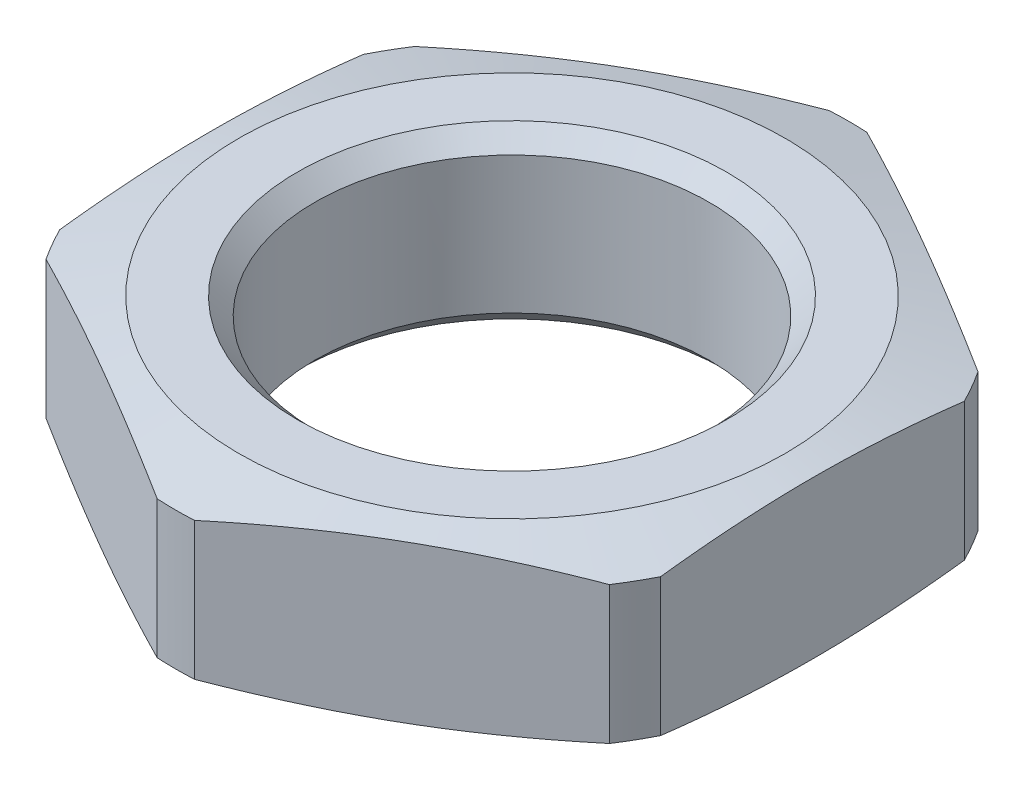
ISO-10303-21;
HEADER;
FILE_DESCRIPTION(('STEP AP214'),'2;1');
FILE_NAME('part.step','',(''),(''),'','','');
FILE_SCHEMA(('AUTOMOTIVE_DESIGN { 1 0 10303 214 1 1 1 1 }'));
ENDSEC;
DATA;
#1=APPLICATION_CONTEXT('core data for automotive mechanical design processes');
#2=APPLICATION_PROTOCOL_DEFINITION('international standard','automotive_design',2000,#1);
#3=PRODUCT_CONTEXT('',#1,'mechanical');
#4=PRODUCT('Part','Part','',(#3));
#5=PRODUCT_RELATED_PRODUCT_CATEGORY('part','',(#4));
#6=PRODUCT_DEFINITION_FORMATION('','',#4);
#7=PRODUCT_DEFINITION_CONTEXT('part definition',#1,'design');
#8=PRODUCT_DEFINITION('design','',#6,#7);
#9=PRODUCT_DEFINITION_SHAPE('','',#8);
#10=(LENGTH_UNIT() NAMED_UNIT(*) SI_UNIT(.MILLI.,.METRE.));
#11=(NAMED_UNIT(*) PLANE_ANGLE_UNIT() SI_UNIT($,.RADIAN.));
#12=(NAMED_UNIT(*) SI_UNIT($,.STERADIAN.) SOLID_ANGLE_UNIT());
#13=UNCERTAINTY_MEASURE_WITH_UNIT(LENGTH_MEASURE(1.E-05),#10,'distance_accuracy_value','');
#14=(GEOMETRIC_REPRESENTATION_CONTEXT(3) GLOBAL_UNCERTAINTY_ASSIGNED_CONTEXT((#13)) GLOBAL_UNIT_ASSIGNED_CONTEXT((#10,
#11,#12)) REPRESENTATION_CONTEXT('',''));
#15=CARTESIAN_POINT('',(0.,0.,0.));
#16=DIRECTION('',(0.,0.,1.));
#17=DIRECTION('',(1.,0.,0.));
#18=AXIS2_PLACEMENT_3D('',#15,#16,#17);
#19=CARTESIAN_POINT('',(5.,0.,0.));
#20=DIRECTION('',(0.,1.,0.));
#21=DIRECTION('',(0.,0.,1.));
#22=AXIS2_PLACEMENT_3D('',#19,#20,#21);
#23=PLANE('',#22);
#24=CARTESIAN_POINT('',(0.,0.,0.));
#25=DIRECTION('',(0.,-1.,0.));
#26=DIRECTION('',(0.,0.,-1.));
#27=AXIS2_PLACEMENT_3D('',#24,#25,#26);
#28=CIRCLE('',#27,4.99999999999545);
#29=CARTESIAN_POINT('',(0.,0.,-4.99999999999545));
#30=VERTEX_POINT('',#29);
#31=EDGE_CURVE('E20',#30,#30,#28,.F.);
#32=ORIENTED_EDGE('',*,*,#31,.T.);
#33=EDGE_LOOP('',(#32));
#34=FACE_BOUND('',#33,.T.);
#35=CARTESIAN_POINT('',(0.,2.04063111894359E-12,0.));
#36=DIRECTION('',(0.,1.,0.));
#37=DIRECTION('',(0.,0.,1.));
#38=AXIS2_PLACEMENT_3D('',#35,#36,#37);
#39=CIRCLE('',#38,6.36363636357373);
#40=CARTESIAN_POINT('',(0.,2.04063111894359E-12,6.36363636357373));
#41=VERTEX_POINT('',#40);
#42=EDGE_CURVE('E153',#41,#41,#39,.T.);
#43=ORIENTED_EDGE('',*,*,#42,.F.);
#44=EDGE_LOOP('',(#43));
#45=FACE_BOUND('',#44,.T.);
#46=ADVANCED_FACE('F17',(#34,#45),#23,.F.);
#47=CARTESIAN_POINT('',(0.,5.6843418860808E-11,0.));
#48=DIRECTION('',(0.,-1.,0.));
#49=DIRECTION('',(0.,0.,-1.));
#50=AXIS2_PLACEMENT_3D('',#47,#48,#49);
#51=CONICAL_SURFACE('',#50,4.99999999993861,0.785398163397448);
#52=CARTESIAN_POINT('',(0.,0.406,0.));
#53=DIRECTION('',(0.,1.,0.));
#54=DIRECTION('',(0.,0.,1.));
#55=AXIS2_PLACEMENT_3D('',#52,#53,#54);
#56=CIRCLE('',#55,4.594);
#57=CARTESIAN_POINT('',(0.,0.406,4.594));
#58=VERTEX_POINT('',#57);
#59=EDGE_CURVE('E128',#58,#58,#56,.T.);
#60=ORIENTED_EDGE('',*,*,#59,.T.);
#61=EDGE_LOOP('',(#60));
#62=FACE_BOUND('',#61,.T.);
#63=ORIENTED_EDGE('',*,*,#31,.F.);
#64=EDGE_LOOP('',(#63));
#65=FACE_BOUND('',#64,.T.);
#66=ADVANCED_FACE('F397',(#62,#65),#51,.F.);
#67=CARTESIAN_POINT('',(0.,-4.,0.));
#68=DIRECTION('',(0.,1.,0.));
#69=DIRECTION('',(0.,0.,1.));
#70=AXIS2_PLACEMENT_3D('',#67,#68,#69);
#71=CYLINDRICAL_SURFACE('',#70,7.84313725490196);
#72=CARTESIAN_POINT('',(0.,0.396431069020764,0.));
#73=DIRECTION('',(0.,1.,0.));
#74=DIRECTION('',(0.,0.,1.));
#75=AXIS2_PLACEMENT_3D('',#72,#73,#74);
#76=CIRCLE('',#75,7.84313725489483);
#77=CARTESIAN_POINT('',(7.,0.39643106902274,3.53762660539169));
#78=VERTEX_POINT('',#77);
#79=CARTESIAN_POINT('',(6.5636745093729,0.396431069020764,4.29336452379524));
#80=VERTEX_POINT('',#79);
#81=EDGE_CURVE('E107',#78,#80,#76,.F.);
#82=ORIENTED_EDGE('',*,*,#81,.F.);
#83=DIRECTION('',(0.,1.,0.));
#84=VECTOR('',#83,1.);
#85=CARTESIAN_POINT('',(7.,-4.,3.53762660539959));
#86=LINE('',#85,#84);
#87=CARTESIAN_POINT('',(7.,3.60356893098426,3.53762660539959));
#88=VERTEX_POINT('',#87);
#89=EDGE_CURVE('E443',#88,#78,#86,.F.);
#90=ORIENTED_EDGE('',*,*,#89,.F.);
#91=CARTESIAN_POINT('',(0.,3.60356893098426,0.));
#92=DIRECTION('',(0.,1.,0.));
#93=DIRECTION('',(0.,0.,1.));
#94=AXIS2_PLACEMENT_3D('',#91,#92,#93);
#95=CIRCLE('',#94,7.84313725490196);
#96=CARTESIAN_POINT('',(6.56367450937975,3.60356893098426,4.29336452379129));
#97=VERTEX_POINT('',#96);
#98=EDGE_CURVE('E119',#88,#97,#95,.F.);
#99=ORIENTED_EDGE('',*,*,#98,.T.);
#100=DIRECTION('',(0.,1.,0.));
#101=VECTOR('',#100,1.);
#102=CARTESIAN_POINT('',(6.56367450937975,-4.,4.29336452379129));
#103=LINE('',#102,#101);
#104=EDGE_CURVE('E125',#80,#97,#103,.T.);
#105=ORIENTED_EDGE('',*,*,#104,.F.);
#106=EDGE_LOOP('',(#82,#90,#99,#105));
#107=FACE_BOUND('',#106,.T.);
#108=ADVANCED_FACE('F130',(#107),#71,.T.);
#109=CARTESIAN_POINT('',(0.,-4.,0.));
#110=DIRECTION('',(0.,1.,0.));
#111=DIRECTION('',(0.,0.,1.));
#112=AXIS2_PLACEMENT_3D('',#109,#110,#111);
#113=CYLINDRICAL_SURFACE('',#112,7.84313725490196);
#114=CARTESIAN_POINT('',(0.,0.396431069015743,0.));
#115=DIRECTION('',(0.,1.,0.));
#116=DIRECTION('',(0.,0.,1.));
#117=AXIS2_PLACEMENT_3D('',#114,#115,#116);
#118=CIRCLE('',#117,7.84313725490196);
#119=CARTESIAN_POINT('',(7.,0.396431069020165,-3.53762660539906));
#120=VERTEX_POINT('',#119);
#121=CARTESIAN_POINT('',(6.56367450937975,0.396431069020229,-4.29336452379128));
#122=VERTEX_POINT('',#121);
#123=EDGE_CURVE('E161',#120,#122,#118,.T.);
#124=ORIENTED_EDGE('',*,*,#123,.T.);
#125=DIRECTION('',(0.,1.,0.));
#126=VECTOR('',#125,1.);
#127=CARTESIAN_POINT('',(6.56367450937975,-4.,-4.29336452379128));
#128=LINE('',#127,#126);
#129=CARTESIAN_POINT('',(6.56367450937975,3.60356893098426,-4.29336452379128));
#130=VERTEX_POINT('',#129);
#131=EDGE_CURVE('E431',#130,#122,#128,.F.);
#132=ORIENTED_EDGE('',*,*,#131,.F.);
#133=CARTESIAN_POINT('',(0.,3.60356893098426,0.));
#134=DIRECTION('',(0.,1.,0.));
#135=DIRECTION('',(0.,0.,1.));
#136=AXIS2_PLACEMENT_3D('',#133,#134,#135);
#137=CIRCLE('',#136,7.84313725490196);
#138=CARTESIAN_POINT('',(7.,3.60356893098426,-3.53762660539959));
#139=VERTEX_POINT('',#138);
#140=EDGE_CURVE('E118',#130,#139,#137,.F.);
#141=ORIENTED_EDGE('',*,*,#140,.T.);
#142=DIRECTION('',(0.,1.,0.));
#143=VECTOR('',#142,1.);
#144=CARTESIAN_POINT('',(7.,-4.,-3.53762660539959));
#145=LINE('',#144,#143);
#146=EDGE_CURVE('E434',#120,#139,#145,.T.);
#147=ORIENTED_EDGE('',*,*,#146,.F.);
#148=EDGE_LOOP('',(#124,#132,#141,#147));
#149=FACE_BOUND('',#148,.T.);
#150=ADVANCED_FACE('F381',(#149),#113,.T.);
#151=CARTESIAN_POINT('',(0.,-4.,0.));
#152=DIRECTION('',(0.,1.,0.));
#153=DIRECTION('',(0.,0.,1.));
#154=AXIS2_PLACEMENT_3D('',#151,#152,#153);
#155=CYLINDRICAL_SURFACE('',#154,7.84313725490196);
#156=CARTESIAN_POINT('',(0.,0.396431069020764,0.));
#157=DIRECTION('',(0.,1.,0.));
#158=DIRECTION('',(0.,0.,1.));
#159=AXIS2_PLACEMENT_3D('',#156,#157,#158);
#160=CIRCLE('',#159,7.84313725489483);
#161=CARTESIAN_POINT('',(-0.436325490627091,0.39643106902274,-7.83099112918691));
#162=VERTEX_POINT('',#161);
#163=CARTESIAN_POINT('',(0.436325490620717,0.396431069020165,-7.8309911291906));
#164=VERTEX_POINT('',#163);
#165=EDGE_CURVE('E145',#162,#164,#160,.F.);
#166=ORIENTED_EDGE('',*,*,#165,.F.);
#167=DIRECTION('',(0.,1.,0.));
#168=VECTOR('',#167,1.);
#169=CARTESIAN_POINT('',(-0.436325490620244,-4.,-7.83099112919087));
#170=LINE('',#169,#168);
#171=CARTESIAN_POINT('',(-0.436325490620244,3.60356893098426,-7.83099112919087));
#172=VERTEX_POINT('',#171);
#173=EDGE_CURVE('E451',#172,#162,#170,.F.);
#174=ORIENTED_EDGE('',*,*,#173,.F.);
#175=CARTESIAN_POINT('',(0.,3.60356893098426,0.));
#176=DIRECTION('',(0.,1.,0.));
#177=DIRECTION('',(0.,0.,1.));
#178=AXIS2_PLACEMENT_3D('',#175,#176,#177);
#179=CIRCLE('',#178,7.84313725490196);
#180=CARTESIAN_POINT('',(0.436325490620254,3.60356893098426,-7.83099112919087));
#181=VERTEX_POINT('',#180);
#182=EDGE_CURVE('E154',#172,#181,#179,.F.);
#183=ORIENTED_EDGE('',*,*,#182,.T.);
#184=DIRECTION('',(0.,1.,0.));
#185=VECTOR('',#184,1.);
#186=CARTESIAN_POINT('',(0.436325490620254,-4.,-7.83099112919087));
#187=LINE('',#186,#185);
#188=EDGE_CURVE('E441',#164,#181,#187,.T.);
#189=ORIENTED_EDGE('',*,*,#188,.F.);
#190=EDGE_LOOP('',(#166,#174,#183,#189));
#191=FACE_BOUND('',#190,.T.);
#192=ADVANCED_FACE('F373',(#191),#155,.T.);
#193=CARTESIAN_POINT('',(0.,-4.,0.));
#194=DIRECTION('',(0.,1.,0.));
#195=DIRECTION('',(0.,0.,1.));
#196=AXIS2_PLACEMENT_3D('',#193,#194,#195);
#197=CYLINDRICAL_SURFACE('',#196,7.84313725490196);
#198=CARTESIAN_POINT('',(0.,0.396431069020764,0.));
#199=DIRECTION('',(0.,1.,0.));
#200=DIRECTION('',(0.,0.,1.));
#201=AXIS2_PLACEMENT_3D('',#198,#199,#200);
#202=CIRCLE('',#201,7.84313725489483);
#203=CARTESIAN_POINT('',(-7.,0.39643106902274,-3.53762660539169));
#204=VERTEX_POINT('',#203);
#205=CARTESIAN_POINT('',(-6.56367450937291,0.396431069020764,-4.29336452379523));
#206=VERTEX_POINT('',#205);
#207=EDGE_CURVE('E155',#204,#206,#202,.F.);
#208=ORIENTED_EDGE('',*,*,#207,.F.);
#209=DIRECTION('',(0.,1.,0.));
#210=VECTOR('',#209,1.);
#211=CARTESIAN_POINT('',(-7.,-4.,-3.53762660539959));
#212=LINE('',#211,#210);
#213=CARTESIAN_POINT('',(-7.,3.60356893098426,-3.53762660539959));
#214=VERTEX_POINT('',#213);
#215=EDGE_CURVE('E208',#214,#204,#212,.F.);
#216=ORIENTED_EDGE('',*,*,#215,.F.);
#217=CARTESIAN_POINT('',(0.,3.60356893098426,0.));
#218=DIRECTION('',(0.,1.,0.));
#219=DIRECTION('',(0.,0.,1.));
#220=AXIS2_PLACEMENT_3D('',#217,#218,#219);
#221=CIRCLE('',#220,7.84313725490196);
#222=CARTESIAN_POINT('',(-6.56367450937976,3.60356893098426,-4.29336452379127));
#223=VERTEX_POINT('',#222);
#224=EDGE_CURVE('E151',#214,#223,#221,.F.);
#225=ORIENTED_EDGE('',*,*,#224,.T.);
#226=DIRECTION('',(0.,1.,0.));
#227=VECTOR('',#226,1.);
#228=CARTESIAN_POINT('',(-6.56367450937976,-4.,-4.29336452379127));
#229=LINE('',#228,#227);
#230=EDGE_CURVE('E448',#206,#223,#229,.T.);
#231=ORIENTED_EDGE('',*,*,#230,.F.);
#232=EDGE_LOOP('',(#208,#216,#225,#231));
#233=FACE_BOUND('',#232,.T.);
#234=ADVANCED_FACE('F224',(#233),#197,.T.);
#235=CARTESIAN_POINT('',(0.,0.396431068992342,0.));
#236=DIRECTION('',(0.,1.,0.));
#237=DIRECTION('',(0.,0.,1.));
#238=AXIS2_PLACEMENT_3D('',#235,#236,#237);
#239=CONICAL_SURFACE('',#238,7.84313725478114,1.30899693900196);
#240=ORIENTED_EDGE('',*,*,#42,.T.);
#241=EDGE_LOOP('',(#240));
#242=FACE_BOUND('',#241,.T.);
#243=CARTESIAN_POINT('',(-0.436325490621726,0.396431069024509,-7.83099112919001));
#244=CARTESIAN_POINT('',(-0.690919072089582,0.360879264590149,-7.68400145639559));
#245=CARTESIAN_POINT('',(-0.945907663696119,0.328839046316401,-7.53678372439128));
#246=CARTESIAN_POINT('',(-1.45660989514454,0.272827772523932,-7.24192965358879));
#247=CARTESIAN_POINT('',(-1.71232370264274,0.248858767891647,-7.0942932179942));
#248=CARTESIAN_POINT('',(-2.22323760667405,0.210134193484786,-6.799316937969));
#249=CARTESIAN_POINT('',(-2.4784355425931,0.195341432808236,-6.6519783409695));
#250=CARTESIAN_POINT('',(-2.98908900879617,0.175531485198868,-6.35715242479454));
#251=CARTESIAN_POINT('',(-3.24454450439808,0.170513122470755,-6.20966512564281));
#252=CARTESIAN_POINT('',(-3.75545549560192,0.170513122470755,-5.91469052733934));
#253=CARTESIAN_POINT('',(-4.01091099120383,0.175531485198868,-5.7672032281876));
#254=CARTESIAN_POINT('',(-4.5215644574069,0.195341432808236,-5.47237731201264));
#255=CARTESIAN_POINT('',(-4.77676239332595,0.210134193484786,-5.32503871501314));
#256=CARTESIAN_POINT('',(-5.28767629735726,0.248858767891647,-5.03006243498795));
#257=CARTESIAN_POINT('',(-5.54339010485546,0.272827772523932,-4.88242599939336));
#258=CARTESIAN_POINT('',(-6.05409233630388,0.328839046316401,-4.58757192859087));
#259=CARTESIAN_POINT('',(-6.30908092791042,0.360879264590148,-4.44035419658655));
#260=CARTESIAN_POINT('',(-6.56367450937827,0.396431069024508,-4.29336452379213));
#261=B_SPLINE_CURVE_WITH_KNOTS('',3,(#243,#244,#245,#246,#247,#248,#249,#250,#251,#252,#253,
#254,#255,#256,#257,#258,#259,#260),.UNSPECIFIED.,.F.,.F.,(4,2,2,2,2,2,2,2,4),(0.,
0.888389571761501,1.77700471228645,2.66199439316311,3.54687760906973,4.43176082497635,
5.31675050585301,6.20536564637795,7.09375521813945),.UNSPECIFIED.);
#262=EDGE_CURVE('E230',#162,#206,#261,.T.);
#263=ORIENTED_EDGE('',*,*,#262,.F.);
#264=ORIENTED_EDGE('',*,*,#165,.T.);
#265=CARTESIAN_POINT('',(6.56367450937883,0.396431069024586,-4.29336452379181));
#266=CARTESIAN_POINT('',(6.30908092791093,0.360879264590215,-4.44035419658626));
#267=CARTESIAN_POINT('',(6.05409233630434,0.328839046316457,-4.5875719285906));
#268=CARTESIAN_POINT('',(5.54339010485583,0.272827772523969,-4.88242599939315));
#269=CARTESIAN_POINT('',(5.28767629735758,0.248858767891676,-5.03006243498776));
#270=CARTESIAN_POINT('',(4.77676239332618,0.210134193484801,-5.32503871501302));
#271=CARTESIAN_POINT('',(4.52156445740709,0.195341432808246,-5.47237731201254));
#272=CARTESIAN_POINT('',(4.01091099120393,0.175531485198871,-5.76720322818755));
#273=CARTESIAN_POINT('',(3.75545549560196,0.170513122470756,-5.91469052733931));
#274=CARTESIAN_POINT('',(3.24454450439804,0.170513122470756,-6.20966512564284));
#275=CARTESIAN_POINT('',(2.98908900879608,0.175531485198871,-6.3571524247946));
#276=CARTESIAN_POINT('',(2.47843554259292,0.195341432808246,-6.65197834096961));
#277=CARTESIAN_POINT('',(2.22323760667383,0.210134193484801,-6.79931693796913));
#278=CARTESIAN_POINT('',(1.71232370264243,0.248858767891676,-7.09429321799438));
#279=CARTESIAN_POINT('',(1.45660989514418,0.272827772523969,-7.241929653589));
#280=CARTESIAN_POINT('',(0.945907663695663,0.328839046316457,-7.53678372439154));
#281=CARTESIAN_POINT('',(0.69091907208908,0.360879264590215,-7.68400145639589));
#282=CARTESIAN_POINT('',(0.436325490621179,0.396431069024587,-7.83099112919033));
#283=B_SPLINE_CURVE_WITH_KNOTS('',3,(#265,#266,#267,#268,#269,#270,#271,#272,#273,#274,#275,
#276,#277,#278,#279,#280,#281,#282),.UNSPECIFIED.,.F.,.F.,(4,2,2,2,2,2,2,2,4),(0.,
0.888389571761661,1.77700471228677,2.66199439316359,3.54687760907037,4.43176082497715,
5.31675050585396,6.20536564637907,7.09375521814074),.UNSPECIFIED.);
#284=EDGE_CURVE('E237',#122,#164,#283,.T.);
#285=ORIENTED_EDGE('',*,*,#284,.F.);
#286=ORIENTED_EDGE('',*,*,#123,.F.);
#287=CARTESIAN_POINT('',(7.,0.396431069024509,3.53762660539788));
#288=CARTESIAN_POINT('',(7.,0.360879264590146,3.24364725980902));
#289=CARTESIAN_POINT('',(7.,0.328839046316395,2.94921179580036));
#290=CARTESIAN_POINT('',(7.,0.272827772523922,2.35950365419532));
#291=CARTESIAN_POINT('',(7.,0.248858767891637,2.06423078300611));
#292=CARTESIAN_POINT('',(7.,0.210134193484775,1.47427822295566));
#293=CARTESIAN_POINT('',(7.,0.195341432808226,1.17960102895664));
#294=CARTESIAN_POINT('',(7.,0.175531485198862,0.589949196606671));
#295=CARTESIAN_POINT('',(7.,0.170513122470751,0.294974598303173));
#296=CARTESIAN_POINT('',(7.,0.170513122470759,-0.294974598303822));
#297=CARTESIAN_POINT('',(7.,0.175531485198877,-0.589949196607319));
#298=CARTESIAN_POINT('',(7.,0.195341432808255,-1.17960102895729));
#299=CARTESIAN_POINT('',(7.,0.210134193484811,-1.47427822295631));
#300=CARTESIAN_POINT('',(7.,0.248858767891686,-2.06423078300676));
#301=CARTESIAN_POINT('',(7.,0.272827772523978,-2.35950365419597));
#302=CARTESIAN_POINT('',(7.,0.328839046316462,-2.949211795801));
#303=CARTESIAN_POINT('',(7.,0.360879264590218,-3.24364725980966));
#304=CARTESIAN_POINT('',(7.,0.396431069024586,-3.53762660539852));
#305=B_SPLINE_CURVE_WITH_KNOTS('',3,(#287,#288,#289,#290,#291,#292,#293,#294,#295,#296,#297,
#298,#299,#300,#301,#302,#303,#304),.UNSPECIFIED.,.F.,.F.,(4,2,2,2,2,2,2,2,4),(0.,
0.888389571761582,1.77700471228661,2.66199439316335,3.54687760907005,4.43176082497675,
5.31675050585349,6.20536564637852,7.0937552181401),.UNSPECIFIED.);
#306=EDGE_CURVE('E113',#78,#120,#305,.T.);
#307=ORIENTED_EDGE('',*,*,#306,.F.);
#308=ORIENTED_EDGE('',*,*,#81,.T.);
#309=CARTESIAN_POINT('',(0.436325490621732,0.39643106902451,7.83099112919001));
#310=CARTESIAN_POINT('',(0.690919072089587,0.360879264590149,7.6840014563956));
#311=CARTESIAN_POINT('',(0.945907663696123,0.328839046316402,7.53678372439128));
#312=CARTESIAN_POINT('',(1.45660989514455,0.272827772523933,7.24192965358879));
#313=CARTESIAN_POINT('',(1.71232370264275,0.248858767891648,7.0942932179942));
#314=CARTESIAN_POINT('',(2.22323760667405,0.210134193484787,6.799316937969));
#315=CARTESIAN_POINT('',(2.4784355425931,0.195341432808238,6.6519783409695));
#316=CARTESIAN_POINT('',(2.98908900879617,0.17553148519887,6.35715242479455));
#317=CARTESIAN_POINT('',(3.24454450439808,0.170513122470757,6.20966512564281));
#318=CARTESIAN_POINT('',(3.75545549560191,0.170513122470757,5.91469052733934));
#319=CARTESIAN_POINT('',(4.01091099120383,0.17553148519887,5.76720322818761));
#320=CARTESIAN_POINT('',(4.52156445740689,0.195341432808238,5.47237731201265));
#321=CARTESIAN_POINT('',(4.77676239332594,0.210134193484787,5.32503871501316));
#322=CARTESIAN_POINT('',(5.28767629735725,0.248858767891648,5.03006243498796));
#323=CARTESIAN_POINT('',(5.54339010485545,0.272827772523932,4.88242599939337));
#324=CARTESIAN_POINT('',(6.05409233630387,0.328839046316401,4.58757192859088));
#325=CARTESIAN_POINT('',(6.30908092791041,0.360879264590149,4.44035419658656));
#326=CARTESIAN_POINT('',(6.56367450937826,0.396431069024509,4.29336452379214));
#327=B_SPLINE_CURVE_WITH_KNOTS('',3,(#309,#310,#311,#312,#313,#314,#315,#316,#317,#318,#319,
#320,#321,#322,#323,#324,#325,#326),.UNSPECIFIED.,.F.,.F.,(4,2,2,2,2,2,2,2,4),(0.,
0.888389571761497,1.77700471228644,2.6619943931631,3.54687760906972,4.43176082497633,
5.31675050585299,6.20536564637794,7.09375521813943),.UNSPECIFIED.);
#328=CARTESIAN_POINT('',(0.436325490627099,0.39643106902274,7.83099112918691));
#329=VERTEX_POINT('',#328);
#330=EDGE_CURVE('E111',#329,#80,#327,.T.);
#331=ORIENTED_EDGE('',*,*,#330,.F.);
#332=CARTESIAN_POINT('',(0.,0.396431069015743,0.));
#333=DIRECTION('',(0.,1.,0.));
#334=DIRECTION('',(0.,0.,1.));
#335=AXIS2_PLACEMENT_3D('',#332,#333,#334);
#336=CIRCLE('',#335,7.84313725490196);
#337=CARTESIAN_POINT('',(-0.4363254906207,0.396431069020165,7.8309911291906));
#338=VERTEX_POINT('',#337);
#339=EDGE_CURVE('E101',#338,#329,#336,.T.);
#340=ORIENTED_EDGE('',*,*,#339,.F.);
#341=CARTESIAN_POINT('',(-6.56367450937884,0.396431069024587,4.2933645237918));
#342=CARTESIAN_POINT('',(-6.30908092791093,0.360879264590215,4.44035419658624));
#343=CARTESIAN_POINT('',(-6.05409233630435,0.328839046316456,4.58757192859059));
#344=CARTESIAN_POINT('',(-5.54339010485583,0.272827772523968,4.88242599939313));
#345=CARTESIAN_POINT('',(-5.28767629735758,0.248858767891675,5.03006243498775));
#346=CARTESIAN_POINT('',(-4.77676239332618,0.2101341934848,5.325038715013));
#347=CARTESIAN_POINT('',(-4.52156445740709,0.195341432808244,5.47237731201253));
#348=CARTESIAN_POINT('',(-4.01091099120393,0.175531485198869,5.76720322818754));
#349=CARTESIAN_POINT('',(-3.75545549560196,0.170513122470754,5.9146905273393));
#350=CARTESIAN_POINT('',(-3.24454450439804,0.170513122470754,6.20966512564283));
#351=CARTESIAN_POINT('',(-2.98908900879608,0.175531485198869,6.35715242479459));
#352=CARTESIAN_POINT('',(-2.47843554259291,0.195341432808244,6.6519783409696));
#353=CARTESIAN_POINT('',(-2.22323760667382,0.210134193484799,6.79931693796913));
#354=CARTESIAN_POINT('',(-1.71232370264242,0.248858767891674,7.09429321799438));
#355=CARTESIAN_POINT('',(-1.45660989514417,0.272827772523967,7.241929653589));
#356=CARTESIAN_POINT('',(-0.945907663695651,0.328839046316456,7.53678372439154));
#357=CARTESIAN_POINT('',(-0.690919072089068,0.360879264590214,7.68400145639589));
#358=CARTESIAN_POINT('',(-0.436325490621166,0.396431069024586,7.83099112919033));
#359=B_SPLINE_CURVE_WITH_KNOTS('',3,(#341,#342,#343,#344,#345,#346,#347,#348,#349,#350,#351,
#352,#353,#354,#355,#356,#357,#358),.UNSPECIFIED.,.F.,.F.,(4,2,2,2,2,2,2,2,4),(0.,
0.888389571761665,1.77700471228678,2.6619943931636,3.54687760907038,4.43176082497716,
5.31675050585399,6.2053656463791,7.09375521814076),.UNSPECIFIED.);
#360=CARTESIAN_POINT('',(-6.56367450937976,0.396431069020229,4.29336452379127));
#361=VERTEX_POINT('',#360);
#362=EDGE_CURVE('E200',#361,#338,#359,.T.);
#363=ORIENTED_EDGE('',*,*,#362,.F.);
#364=CARTESIAN_POINT('',(0.,0.396431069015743,0.));
#365=DIRECTION('',(0.,1.,0.));
#366=DIRECTION('',(0.,0.,1.));
#367=AXIS2_PLACEMENT_3D('',#364,#365,#366);
#368=CIRCLE('',#367,7.84313725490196);
#369=CARTESIAN_POINT('',(-7.,0.396431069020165,3.53762660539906));
#370=VERTEX_POINT('',#369);
#371=EDGE_CURVE('E142',#370,#361,#368,.T.);
#372=ORIENTED_EDGE('',*,*,#371,.F.);
#373=CARTESIAN_POINT('',(-7.,0.396431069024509,-3.53762660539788));
#374=CARTESIAN_POINT('',(-7.,0.360879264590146,-3.24364725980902));
#375=CARTESIAN_POINT('',(-7.,0.328839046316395,-2.94921179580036));
#376=CARTESIAN_POINT('',(-7.,0.272827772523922,-2.35950365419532));
#377=CARTESIAN_POINT('',(-7.,0.248858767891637,-2.06423078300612));
#378=CARTESIAN_POINT('',(-7.,0.210134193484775,-1.47427822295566));
#379=CARTESIAN_POINT('',(-7.,0.195341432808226,-1.17960102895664));
#380=CARTESIAN_POINT('',(-7.,0.175531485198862,-0.589949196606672));
#381=CARTESIAN_POINT('',(-7.,0.170513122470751,-0.294974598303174));
#382=CARTESIAN_POINT('',(-7.,0.170513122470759,0.294974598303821));
#383=CARTESIAN_POINT('',(-7.,0.175531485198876,0.589949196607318));
#384=CARTESIAN_POINT('',(-7.,0.195341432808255,1.17960102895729));
#385=CARTESIAN_POINT('',(-7.,0.210134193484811,1.47427822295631));
#386=CARTESIAN_POINT('',(-7.,0.248858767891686,2.06423078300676));
#387=CARTESIAN_POINT('',(-7.,0.272827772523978,2.35950365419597));
#388=CARTESIAN_POINT('',(-7.,0.328839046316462,2.949211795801));
#389=CARTESIAN_POINT('',(-7.,0.360879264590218,3.24364725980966));
#390=CARTESIAN_POINT('',(-7.,0.396431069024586,3.53762660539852));
#391=B_SPLINE_CURVE_WITH_KNOTS('',3,(#373,#374,#375,#376,#377,#378,#379,#380,#381,#382,#383,
#384,#385,#386,#387,#388,#389,#390),.UNSPECIFIED.,.F.,.F.,(4,2,2,2,2,2,2,2,4),(0.,
0.888389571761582,1.77700471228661,2.66199439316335,3.54687760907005,4.43176082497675,
5.31675050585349,6.20536564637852,7.0937552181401),.UNSPECIFIED.);
#392=EDGE_CURVE('E214',#204,#370,#391,.T.);
#393=ORIENTED_EDGE('',*,*,#392,.F.);
#394=ORIENTED_EDGE('',*,*,#207,.T.);
#395=EDGE_LOOP('',(#263,#264,#285,#286,#307,#308,#331,#340,#363,#372,#393,#394));
#396=FACE_BOUND('',#395,.T.);
#397=ADVANCED_FACE('F110',(#242,#396),#239,.T.);
#398=CARTESIAN_POINT('',(0.,-4.,0.));
#399=DIRECTION('',(0.,1.,0.));
#400=DIRECTION('',(0.,0.,1.));
#401=AXIS2_PLACEMENT_3D('',#398,#399,#400);
#402=CYLINDRICAL_SURFACE('',#401,7.84313725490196);
#403=CARTESIAN_POINT('',(0.,3.60356893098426,0.));
#404=DIRECTION('',(0.,1.,0.));
#405=DIRECTION('',(0.,0.,1.));
#406=AXIS2_PLACEMENT_3D('',#403,#404,#405);
#407=CIRCLE('',#406,7.84313725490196);
#408=CARTESIAN_POINT('',(0.436325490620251,3.60356893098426,7.83099112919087));
#409=VERTEX_POINT('',#408);
#410=CARTESIAN_POINT('',(-0.436325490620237,3.60356893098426,7.83099112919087));
#411=VERTEX_POINT('',#410);
#412=EDGE_CURVE('E35',#409,#411,#407,.F.);
#413=ORIENTED_EDGE('',*,*,#412,.T.);
#414=DIRECTION('',(0.,1.,0.));
#415=VECTOR('',#414,1.);
#416=CARTESIAN_POINT('',(-0.436325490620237,-4.,7.83099112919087));
#417=LINE('',#416,#415);
#418=EDGE_CURVE('E207',#338,#411,#417,.T.);
#419=ORIENTED_EDGE('',*,*,#418,.F.);
#420=ORIENTED_EDGE('',*,*,#339,.T.);
#421=DIRECTION('',(0.,1.,0.));
#422=VECTOR('',#421,1.);
#423=CARTESIAN_POINT('',(0.436325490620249,-4.,7.83099112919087));
#424=LINE('',#423,#422);
#425=EDGE_CURVE('E127',#409,#329,#424,.F.);
#426=ORIENTED_EDGE('',*,*,#425,.F.);
#427=EDGE_LOOP('',(#413,#419,#420,#426));
#428=FACE_BOUND('',#427,.T.);
#429=ADVANCED_FACE('F223',(#428),#402,.T.);
#430=CARTESIAN_POINT('',(0.,-4.,0.));
#431=DIRECTION('',(0.,1.,0.));
#432=DIRECTION('',(0.,0.,1.));
#433=AXIS2_PLACEMENT_3D('',#430,#431,#432);
#434=CYLINDRICAL_SURFACE('',#433,7.84313725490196);
#435=CARTESIAN_POINT('',(0.,3.60356893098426,0.));
#436=DIRECTION('',(0.,1.,0.));
#437=DIRECTION('',(0.,0.,1.));
#438=AXIS2_PLACEMENT_3D('',#435,#436,#437);
#439=CIRCLE('',#438,7.84313725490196);
#440=CARTESIAN_POINT('',(-6.56367450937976,3.60356893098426,4.29336452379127));
#441=VERTEX_POINT('',#440);
#442=CARTESIAN_POINT('',(-7.,3.60356893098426,3.53762660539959));
#443=VERTEX_POINT('',#442);
#444=EDGE_CURVE('E140',#441,#443,#439,.F.);
#445=ORIENTED_EDGE('',*,*,#444,.T.);
#446=DIRECTION('',(0.,1.,0.));
#447=VECTOR('',#446,1.);
#448=CARTESIAN_POINT('',(-7.,-4.,3.53762660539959));
#449=LINE('',#448,#447);
#450=EDGE_CURVE('E454',#370,#443,#449,.T.);
#451=ORIENTED_EDGE('',*,*,#450,.F.);
#452=ORIENTED_EDGE('',*,*,#371,.T.);
#453=DIRECTION('',(0.,1.,0.));
#454=VECTOR('',#453,1.);
#455=CARTESIAN_POINT('',(-6.56367450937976,-4.,4.29336452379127));
#456=LINE('',#455,#454);
#457=EDGE_CURVE('E139',#441,#361,#456,.F.);
#458=ORIENTED_EDGE('',*,*,#457,.F.);
#459=EDGE_LOOP('',(#445,#451,#452,#458));
#460=FACE_BOUND('',#459,.T.);
#461=ADVANCED_FACE('F259',(#460),#434,.T.);
#462=CARTESIAN_POINT('',(0.,0.,0.));
#463=DIRECTION('',(0.,1.,0.));
#464=DIRECTION('',(0.,0.,1.));
#465=AXIS2_PLACEMENT_3D('',#462,#463,#464);
#466=CYLINDRICAL_SURFACE('',#465,4.594);
#467=ORIENTED_EDGE('',*,*,#59,.F.);
#468=EDGE_LOOP('',(#467));
#469=FACE_BOUND('',#468,.T.);
#470=CARTESIAN_POINT('',(0.,3.59400000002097,0.));
#471=DIRECTION('',(0.,1.,0.));
#472=DIRECTION('',(0.,0.,1.));
#473=AXIS2_PLACEMENT_3D('',#470,#471,#472);
#474=CIRCLE('',#473,4.59399999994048);
#475=CARTESIAN_POINT('',(0.,3.59400000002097,4.59399999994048));
#476=VERTEX_POINT('',#475);
#477=EDGE_CURVE('E135',#476,#476,#474,.T.);
#478=ORIENTED_EDGE('',*,*,#477,.T.);
#479=EDGE_LOOP('',(#478));
#480=FACE_BOUND('',#479,.T.);
#481=ADVANCED_FACE('F255',(#469,#480),#466,.F.);
#482=CARTESIAN_POINT('',(0.,-4.,8.08290376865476));
#483=DIRECTION('',(0.5,0.,0.866025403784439));
#484=DIRECTION('',(0.866025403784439,0.,-0.5));
#485=AXIS2_PLACEMENT_3D('',#482,#483,#484);
#486=PLANE('',#485);
#487=CARTESIAN_POINT('',(0.436325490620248,3.60356893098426,7.83099112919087));
#488=CARTESIAN_POINT('',(0.690919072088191,3.63912073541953,7.6840014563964));
#489=CARTESIAN_POINT('',(0.945907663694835,3.6711609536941,7.53678372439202));
#490=CARTESIAN_POINT('',(1.45660989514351,3.72717222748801,7.24192965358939));
#491=CARTESIAN_POINT('',(1.71232370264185,3.75114123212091,7.09429321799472));
#492=CARTESIAN_POINT('',(2.22323760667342,3.78986580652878,6.79931693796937));
#493=CARTESIAN_POINT('',(2.47843554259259,3.80465856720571,6.6519783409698));
#494=CARTESIAN_POINT('',(2.9890890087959,3.82446851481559,6.3571524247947));
#495=CARTESIAN_POINT('',(3.24454450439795,3.82948687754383,6.20966512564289));
#496=CARTESIAN_POINT('',(3.75545549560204,3.82948687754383,5.91469052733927));
#497=CARTESIAN_POINT('',(4.01091099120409,3.82446851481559,5.76720322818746));
#498=CARTESIAN_POINT('',(4.52156445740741,3.80465856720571,5.47237731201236));
#499=CARTESIAN_POINT('',(4.77676239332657,3.78986580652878,5.32503871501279));
#500=CARTESIAN_POINT('',(5.28767629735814,3.75114123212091,5.03006243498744));
#501=CARTESIAN_POINT('',(5.54339010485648,3.72717222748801,4.88242599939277));
#502=CARTESIAN_POINT('',(6.05409233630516,3.6711609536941,4.58757192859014));
#503=CARTESIAN_POINT('',(6.3090809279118,3.63912073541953,4.44035419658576));
#504=CARTESIAN_POINT('',(6.56367450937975,3.60356893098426,4.29336452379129));
#505=B_SPLINE_CURVE_WITH_KNOTS('',3,(#487,#488,#489,#490,#491,#492,#493,#494,#495,#496,#497,
#498,#499,#500,#501,#502,#503,#504),.UNSPECIFIED.,.F.,.F.,(4,2,2,2,2,2,2,2,4),(0.,
0.888389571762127,1.77700471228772,2.66199439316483,3.5468776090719,4.43176082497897,
5.31675050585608,6.20536564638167,7.0937552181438),.UNSPECIFIED.);
#506=EDGE_CURVE('E138',#409,#97,#505,.T.);
#507=ORIENTED_EDGE('',*,*,#506,.F.);
#508=ORIENTED_EDGE('',*,*,#425,.T.);
#509=ORIENTED_EDGE('',*,*,#330,.T.);
#510=ORIENTED_EDGE('',*,*,#104,.T.);
#511=EDGE_LOOP('',(#507,#508,#509,#510));
#512=FACE_BOUND('',#511,.T.);
#513=ADVANCED_FACE('F124',(#512),#486,.T.);
#514=CARTESIAN_POINT('',(7.,-4.,4.04145188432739));
#515=DIRECTION('',(1.,0.,0.));
#516=DIRECTION('',(0.,0.,-1.));
#517=AXIS2_PLACEMENT_3D('',#514,#515,#516);
#518=PLANE('',#517);
#519=CARTESIAN_POINT('',(7.,3.60356893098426,3.53762660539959));
#520=CARTESIAN_POINT('',(7.,3.63912073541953,3.24364725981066));
#521=CARTESIAN_POINT('',(7.,3.6711609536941,2.9492117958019));
#522=CARTESIAN_POINT('',(7.,3.72717222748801,2.35950365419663));
#523=CARTESIAN_POINT('',(7.,3.75114123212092,2.06423078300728));
#524=CARTESIAN_POINT('',(7.,3.78986580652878,1.47427822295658));
#525=CARTESIAN_POINT('',(7.,3.80465856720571,1.17960102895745));
#526=CARTESIAN_POINT('',(7.,3.82446851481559,0.589949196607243));
#527=CARTESIAN_POINT('',(7.,3.82948687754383,0.294974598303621));
#528=CARTESIAN_POINT('',(7.,3.82948687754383,-0.294974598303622));
#529=CARTESIAN_POINT('',(7.,3.82446851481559,-0.589949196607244));
#530=CARTESIAN_POINT('',(7.,3.80465856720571,-1.17960102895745));
#531=CARTESIAN_POINT('',(7.,3.78986580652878,-1.47427822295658));
#532=CARTESIAN_POINT('',(7.,3.75114123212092,-2.06423078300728));
#533=CARTESIAN_POINT('',(7.,3.72717222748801,-2.35950365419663));
#534=CARTESIAN_POINT('',(7.,3.6711609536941,-2.9492117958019));
#535=CARTESIAN_POINT('',(7.,3.63912073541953,-3.24364725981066));
#536=CARTESIAN_POINT('',(7.,3.60356893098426,-3.53762660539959));
#537=B_SPLINE_CURVE_WITH_KNOTS('',3,(#519,#520,#521,#522,#523,#524,#525,#526,#527,#528,#529,
#530,#531,#532,#533,#534,#535,#536),.UNSPECIFIED.,.F.,.F.,(4,2,2,2,2,2,2,2,4),(0.,
0.888389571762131,1.77700471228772,2.66199439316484,3.54687760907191,4.43176082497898,
5.3167505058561,6.20536564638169,7.09375521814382),.UNSPECIFIED.);
#538=EDGE_CURVE('E477',#88,#139,#537,.T.);
#539=ORIENTED_EDGE('',*,*,#538,.F.);
#540=ORIENTED_EDGE('',*,*,#89,.T.);
#541=ORIENTED_EDGE('',*,*,#306,.T.);
#542=ORIENTED_EDGE('',*,*,#146,.T.);
#543=EDGE_LOOP('',(#539,#540,#541,#542));
#544=FACE_BOUND('',#543,.T.);
#545=ADVANCED_FACE('F254',(#544),#518,.T.);
#546=CARTESIAN_POINT('',(7.,-4.,-4.04145188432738));
#547=DIRECTION('',(0.5,0.,-0.866025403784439));
#548=DIRECTION('',(-0.866025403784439,0.,-0.5));
#549=AXIS2_PLACEMENT_3D('',#546,#547,#548);
#550=PLANE('',#549);
#551=CARTESIAN_POINT('',(6.56367450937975,3.60356893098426,-4.29336452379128));
#552=CARTESIAN_POINT('',(6.30908092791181,3.63912073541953,-4.44035419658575));
#553=CARTESIAN_POINT('',(6.05409233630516,3.6711609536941,-4.58757192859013));
#554=CARTESIAN_POINT('',(5.54339010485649,3.72717222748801,-4.88242599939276));
#555=CARTESIAN_POINT('',(5.28767629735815,3.75114123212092,-5.03006243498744));
#556=CARTESIAN_POINT('',(4.77676239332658,3.78986580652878,-5.32503871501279));
#557=CARTESIAN_POINT('',(4.52156445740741,3.80465856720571,-5.47237731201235));
#558=CARTESIAN_POINT('',(4.01091099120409,3.82446851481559,-5.76720322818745));
#559=CARTESIAN_POINT('',(3.75545549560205,3.82948687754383,-5.91469052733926));
#560=CARTESIAN_POINT('',(3.24454450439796,3.82948687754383,-6.20966512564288));
#561=CARTESIAN_POINT('',(2.98908900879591,3.82446851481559,-6.3571524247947));
#562=CARTESIAN_POINT('',(2.47843554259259,3.80465856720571,-6.6519783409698));
#563=CARTESIAN_POINT('',(2.22323760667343,3.78986580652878,-6.79931693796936));
#564=CARTESIAN_POINT('',(1.71232370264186,3.75114123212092,-7.09429321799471));
#565=CARTESIAN_POINT('',(1.45660989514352,3.72717222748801,-7.24192965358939));
#566=CARTESIAN_POINT('',(0.94590766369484,3.6711609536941,-7.53678372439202));
#567=CARTESIAN_POINT('',(0.690919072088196,3.63912073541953,-7.6840014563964));
#568=CARTESIAN_POINT('',(0.436325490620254,3.60356893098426,-7.83099112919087));
#569=B_SPLINE_CURVE_WITH_KNOTS('',3,(#551,#552,#553,#554,#555,#556,#557,#558,#559,#560,#561,
#562,#563,#564,#565,#566,#567,#568),.UNSPECIFIED.,.F.,.F.,(4,2,2,2,2,2,2,2,4),(0.,
0.888389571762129,1.77700471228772,2.66199439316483,3.5468776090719,4.43176082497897,
5.31675050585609,6.20536564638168,7.0937552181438),.UNSPECIFIED.);
#570=EDGE_CURVE('E440',#130,#181,#569,.T.);
#571=ORIENTED_EDGE('',*,*,#570,.F.);
#572=ORIENTED_EDGE('',*,*,#131,.T.);
#573=ORIENTED_EDGE('',*,*,#284,.T.);
#574=ORIENTED_EDGE('',*,*,#188,.T.);
#575=EDGE_LOOP('',(#571,#572,#573,#574));
#576=FACE_BOUND('',#575,.T.);
#577=ADVANCED_FACE('F325',(#576),#550,.T.);
#578=CARTESIAN_POINT('',(0.,-4.,-8.08290376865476));
#579=DIRECTION('',(-0.5,0.,-0.866025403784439));
#580=DIRECTION('',(-0.866025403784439,0.,0.5));
#581=AXIS2_PLACEMENT_3D('',#578,#579,#580);
#582=PLANE('',#581);
#583=CARTESIAN_POINT('',(-0.436325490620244,3.60356893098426,-7.83099112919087));
#584=CARTESIAN_POINT('',(-0.690919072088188,3.63912073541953,-7.6840014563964));
#585=CARTESIAN_POINT('',(-0.945907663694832,3.6711609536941,-7.53678372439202));
#586=CARTESIAN_POINT('',(-1.45660989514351,3.72717222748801,-7.24192965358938));
#587=CARTESIAN_POINT('',(-1.71232370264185,3.75114123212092,-7.09429321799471));
#588=CARTESIAN_POINT('',(-2.22323760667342,3.78986580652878,-6.79931693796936));
#589=CARTESIAN_POINT('',(-2.47843554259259,3.80465856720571,-6.65197834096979));
#590=CARTESIAN_POINT('',(-2.98908900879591,3.82446851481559,-6.35715242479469));
#591=CARTESIAN_POINT('',(-3.24454450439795,3.82948687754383,-6.20966512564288));
#592=CARTESIAN_POINT('',(-3.75545549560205,3.82948687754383,-5.91469052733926));
#593=CARTESIAN_POINT('',(-4.01091099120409,3.82446851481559,-5.76720322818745));
#594=CARTESIAN_POINT('',(-4.52156445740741,3.80465856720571,-5.47237731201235));
#595=CARTESIAN_POINT('',(-4.77676239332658,3.78986580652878,-5.32503871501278));
#596=CARTESIAN_POINT('',(-5.28767629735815,3.75114123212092,-5.03006243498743));
#597=CARTESIAN_POINT('',(-5.54339010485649,3.72717222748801,-4.88242599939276));
#598=CARTESIAN_POINT('',(-6.05409233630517,3.6711609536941,-4.58757192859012));
#599=CARTESIAN_POINT('',(-6.30908092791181,3.63912073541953,-4.44035419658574));
#600=CARTESIAN_POINT('',(-6.56367450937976,3.60356893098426,-4.29336452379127));
#601=B_SPLINE_CURVE_WITH_KNOTS('',3,(#583,#584,#585,#586,#587,#588,#589,#590,#591,#592,#593,
#594,#595,#596,#597,#598,#599,#600),.UNSPECIFIED.,.F.,.F.,(4,2,2,2,2,2,2,2,4),(0.,
0.88838957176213,1.77700471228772,2.66199439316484,3.54687760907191,4.43176082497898,
5.3167505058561,6.20536564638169,7.09375521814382),.UNSPECIFIED.);
#602=EDGE_CURVE('E476',#172,#223,#601,.T.);
#603=ORIENTED_EDGE('',*,*,#602,.F.);
#604=ORIENTED_EDGE('',*,*,#173,.T.);
#605=ORIENTED_EDGE('',*,*,#262,.T.);
#606=ORIENTED_EDGE('',*,*,#230,.T.);
#607=EDGE_LOOP('',(#603,#604,#605,#606));
#608=FACE_BOUND('',#607,.T.);
#609=ADVANCED_FACE('F317',(#608),#582,.T.);
#610=CARTESIAN_POINT('',(-7.,-4.,-4.04145188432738));
#611=DIRECTION('',(-1.,0.,0.));
#612=DIRECTION('',(0.,0.,1.));
#613=AXIS2_PLACEMENT_3D('',#610,#611,#612);
#614=PLANE('',#613);
#615=CARTESIAN_POINT('',(-7.,3.60356893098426,-3.53762660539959));
#616=CARTESIAN_POINT('',(-7.,3.63912073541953,-3.24364725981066));
#617=CARTESIAN_POINT('',(-7.,3.6711609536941,-2.9492117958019));
#618=CARTESIAN_POINT('',(-7.,3.72717222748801,-2.35950365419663));
#619=CARTESIAN_POINT('',(-7.,3.75114123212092,-2.06423078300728));
#620=CARTESIAN_POINT('',(-7.,3.78986580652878,-1.47427822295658));
#621=CARTESIAN_POINT('',(-7.,3.80465856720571,-1.17960102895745));
#622=CARTESIAN_POINT('',(-7.,3.82446851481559,-0.589949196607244));
#623=CARTESIAN_POINT('',(-7.,3.82948687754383,-0.294974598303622));
#624=CARTESIAN_POINT('',(-7.,3.82948687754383,0.294974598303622));
#625=CARTESIAN_POINT('',(-7.,3.82446851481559,0.589949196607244));
#626=CARTESIAN_POINT('',(-7.,3.80465856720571,1.17960102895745));
#627=CARTESIAN_POINT('',(-7.,3.78986580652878,1.47427822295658));
#628=CARTESIAN_POINT('',(-7.,3.75114123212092,2.06423078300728));
#629=CARTESIAN_POINT('',(-7.,3.72717222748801,2.35950365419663));
#630=CARTESIAN_POINT('',(-7.,3.6711609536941,2.9492117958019));
#631=CARTESIAN_POINT('',(-7.,3.63912073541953,3.24364725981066));
#632=CARTESIAN_POINT('',(-7.,3.60356893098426,3.53762660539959));
#633=B_SPLINE_CURVE_WITH_KNOTS('',3,(#615,#616,#617,#618,#619,#620,#621,#622,#623,#624,#625,
#626,#627,#628,#629,#630,#631,#632),.UNSPECIFIED.,.F.,.F.,(4,2,2,2,2,2,2,2,4),(0.,
0.888389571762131,1.77700471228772,2.66199439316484,3.54687760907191,4.43176082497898,
5.3167505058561,6.20536564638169,7.09375521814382),.UNSPECIFIED.);
#634=EDGE_CURVE('E179',#214,#443,#633,.T.);
#635=ORIENTED_EDGE('',*,*,#634,.F.);
#636=ORIENTED_EDGE('',*,*,#215,.T.);
#637=ORIENTED_EDGE('',*,*,#392,.T.);
#638=ORIENTED_EDGE('',*,*,#450,.T.);
#639=EDGE_LOOP('',(#635,#636,#637,#638));
#640=FACE_BOUND('',#639,.T.);
#641=ADVANCED_FACE('F194',(#640),#614,.T.);
#642=CARTESIAN_POINT('',(-7.,-4.,4.04145188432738));
#643=DIRECTION('',(-0.5,0.,0.866025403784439));
#644=DIRECTION('',(0.866025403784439,0.,0.5));
#645=AXIS2_PLACEMENT_3D('',#642,#643,#644);
#646=PLANE('',#645);
#647=CARTESIAN_POINT('',(-6.56367450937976,3.60356893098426,4.29336452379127));
#648=CARTESIAN_POINT('',(-6.30908092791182,3.63912073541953,4.44035419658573));
#649=CARTESIAN_POINT('',(-6.05409233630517,3.6711609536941,4.58757192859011));
#650=CARTESIAN_POINT('',(-5.5433901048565,3.72717222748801,4.88242599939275));
#651=CARTESIAN_POINT('',(-5.28767629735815,3.75114123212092,5.03006243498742));
#652=CARTESIAN_POINT('',(-4.77676239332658,3.78986580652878,5.32503871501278));
#653=CARTESIAN_POINT('',(-4.52156445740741,3.80465856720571,5.47237731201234));
#654=CARTESIAN_POINT('',(-4.01091099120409,3.82446851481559,5.76720322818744));
#655=CARTESIAN_POINT('',(-3.75545549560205,3.82948687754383,5.91469052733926));
#656=CARTESIAN_POINT('',(-3.24454450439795,3.82948687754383,6.20966512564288));
#657=CARTESIAN_POINT('',(-2.9890890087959,3.82446851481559,6.35715242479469));
#658=CARTESIAN_POINT('',(-2.47843554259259,3.80465856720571,6.65197834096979));
#659=CARTESIAN_POINT('',(-2.22323760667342,3.78986580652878,6.79931693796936));
#660=CARTESIAN_POINT('',(-1.71232370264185,3.75114123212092,7.09429321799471));
#661=CARTESIAN_POINT('',(-1.4566098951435,3.72717222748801,7.24192965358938));
#662=CARTESIAN_POINT('',(-0.945907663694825,3.6711609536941,7.53678372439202));
#663=CARTESIAN_POINT('',(-0.690919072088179,3.63912073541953,7.6840014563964));
#664=CARTESIAN_POINT('',(-0.436325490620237,3.60356893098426,7.83099112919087));
#665=B_SPLINE_CURVE_WITH_KNOTS('',3,(#647,#648,#649,#650,#651,#652,#653,#654,#655,#656,#657,
#658,#659,#660,#661,#662,#663,#664),.UNSPECIFIED.,.F.,.F.,(4,2,2,2,2,2,2,2,4),(0.,
0.888389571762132,1.77700471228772,2.66199439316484,3.54687760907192,4.43176082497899,
5.31675050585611,6.2053656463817,7.09375521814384),.UNSPECIFIED.);
#666=EDGE_CURVE('E171',#441,#411,#665,.T.);
#667=ORIENTED_EDGE('',*,*,#666,.F.);
#668=ORIENTED_EDGE('',*,*,#457,.T.);
#669=ORIENTED_EDGE('',*,*,#362,.T.);
#670=ORIENTED_EDGE('',*,*,#418,.T.);
#671=EDGE_LOOP('',(#667,#668,#669,#670));
#672=FACE_BOUND('',#671,.T.);
#673=ADVANCED_FACE('F189',(#672),#646,.T.);
#674=CARTESIAN_POINT('',(0.,4.00000000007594,0.));
#675=DIRECTION('',(0.,1.,0.));
#676=DIRECTION('',(0.,0.,1.));
#677=AXIS2_PLACEMENT_3D('',#674,#675,#676);
#678=CONICAL_SURFACE('',#677,4.99999999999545,0.785398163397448);
#679=ORIENTED_EDGE('',*,*,#477,.F.);
#680=EDGE_LOOP('',(#679));
#681=FACE_BOUND('',#680,.T.);
#682=CARTESIAN_POINT('',(0.,4.00000000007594,0.));
#683=DIRECTION('',(0.,1.,0.));
#684=DIRECTION('',(0.,0.,1.));
#685=AXIS2_PLACEMENT_3D('',#682,#683,#684);
#686=CIRCLE('',#685,4.99999999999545);
#687=CARTESIAN_POINT('',(0.,4.00000000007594,4.99999999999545));
#688=VERTEX_POINT('',#687);
#689=EDGE_CURVE('E26',#688,#688,#686,.T.);
#690=ORIENTED_EDGE('',*,*,#689,.T.);
#691=EDGE_LOOP('',(#690));
#692=FACE_BOUND('',#691,.T.);
#693=ADVANCED_FACE('F193',(#681,#692),#678,.F.);
#694=CARTESIAN_POINT('',(0.,3.60356893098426,0.));
#695=DIRECTION('',(0.,-1.,0.));
#696=DIRECTION('',(0.,0.,-1.));
#697=AXIS2_PLACEMENT_3D('',#694,#695,#696);
#698=CONICAL_SURFACE('',#697,7.84313725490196,1.30899693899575);
#699=CARTESIAN_POINT('',(0.,4.,0.));
#700=DIRECTION('',(0.,-1.,0.));
#701=DIRECTION('',(1.,0.,0.));
#702=AXIS2_PLACEMENT_3D('',#699,#700,#701);
#703=CIRCLE('',#702,6.36363636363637);
#704=CARTESIAN_POINT('',(6.36363636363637,4.,0.));
#705=VERTEX_POINT('',#704);
#706=EDGE_CURVE('E11',#705,#705,#703,.T.);
#707=ORIENTED_EDGE('',*,*,#706,.T.);
#708=EDGE_LOOP('',(#707));
#709=FACE_BOUND('',#708,.T.);
#710=ORIENTED_EDGE('',*,*,#666,.T.);
#711=ORIENTED_EDGE('',*,*,#412,.F.);
#712=ORIENTED_EDGE('',*,*,#506,.T.);
#713=ORIENTED_EDGE('',*,*,#98,.F.);
#714=ORIENTED_EDGE('',*,*,#538,.T.);
#715=ORIENTED_EDGE('',*,*,#140,.F.);
#716=ORIENTED_EDGE('',*,*,#570,.T.);
#717=ORIENTED_EDGE('',*,*,#182,.F.);
#718=ORIENTED_EDGE('',*,*,#602,.T.);
#719=ORIENTED_EDGE('',*,*,#224,.F.);
#720=ORIENTED_EDGE('',*,*,#634,.T.);
#721=ORIENTED_EDGE('',*,*,#444,.F.);
#722=EDGE_LOOP('',(#710,#711,#712,#713,#714,#715,#716,#717,#718,#719,#720,#721));
#723=FACE_BOUND('',#722,.T.);
#724=ADVANCED_FACE('F185',(#709,#723),#698,.T.);
#725=CARTESIAN_POINT('',(6.36363636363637,4.,0.));
#726=DIRECTION('',(0.,-1.,0.));
#727=DIRECTION('',(0.,0.,-1.));
#728=AXIS2_PLACEMENT_3D('',#725,#726,#727);
#729=PLANE('',#728);
#730=ORIENTED_EDGE('',*,*,#706,.F.);
#731=EDGE_LOOP('',(#730));
#732=FACE_BOUND('',#731,.T.);
#733=ORIENTED_EDGE('',*,*,#689,.F.);
#734=EDGE_LOOP('',(#733));
#735=FACE_BOUND('',#734,.T.);
#736=ADVANCED_FACE('F267',(#732,#735),#729,.F.);
#737=CLOSED_SHELL('',(#46,#66,#108,#150,#192,#234,#397,#429,#461,#481,#513,#545,#577,#609,#641,
#673,#693,#724,#736));
#738=MANIFOLD_SOLID_BREP('B1',#737);
#739=ADVANCED_BREP_SHAPE_REPRESENTATION('',(#18,#738),#14);
#740=SHAPE_DEFINITION_REPRESENTATION(#9,#739);
ENDSEC;
END-ISO-10303-21;
